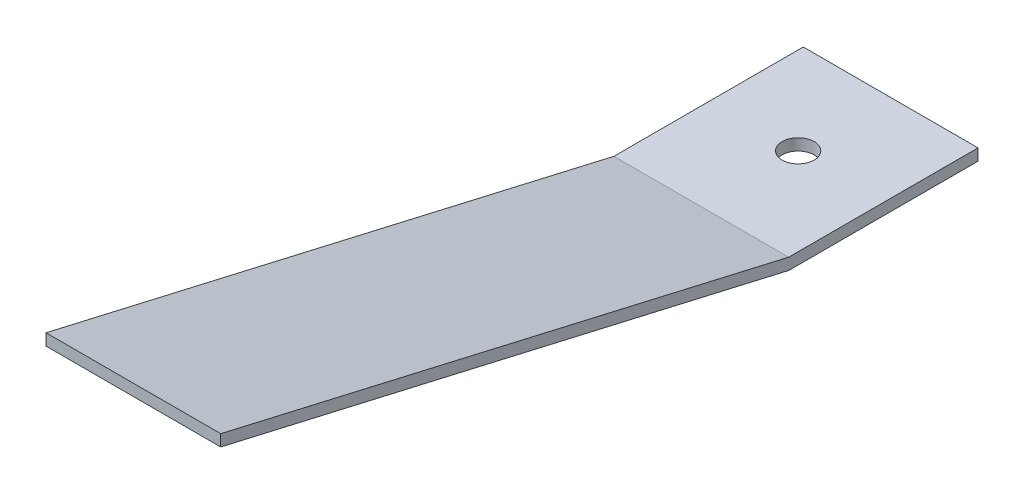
ISO-10303-21;
HEADER;
FILE_DESCRIPTION(('STEP AP214'),'2;1');
FILE_NAME('part.step','',(''),(''),'','','');
FILE_SCHEMA(('AUTOMOTIVE_DESIGN { 1 0 10303 214 1 1 1 1 }'));
ENDSEC;
DATA;
#1=APPLICATION_CONTEXT('core data for automotive mechanical design processes');
#2=APPLICATION_PROTOCOL_DEFINITION('international standard','automotive_design',2000,#1);
#3=PRODUCT_CONTEXT('',#1,'mechanical');
#4=PRODUCT('Part','Part','',(#3));
#5=PRODUCT_RELATED_PRODUCT_CATEGORY('part','',(#4));
#6=PRODUCT_DEFINITION_FORMATION('','',#4);
#7=PRODUCT_DEFINITION_CONTEXT('part definition',#1,'design');
#8=PRODUCT_DEFINITION('design','',#6,#7);
#9=PRODUCT_DEFINITION_SHAPE('','',#8);
#10=(LENGTH_UNIT() NAMED_UNIT(*) SI_UNIT(.MILLI.,.METRE.));
#11=(NAMED_UNIT(*) PLANE_ANGLE_UNIT() SI_UNIT($,.RADIAN.));
#12=(NAMED_UNIT(*) SI_UNIT($,.STERADIAN.) SOLID_ANGLE_UNIT());
#13=UNCERTAINTY_MEASURE_WITH_UNIT(LENGTH_MEASURE(1.E-05),#10,'distance_accuracy_value','');
#14=(GEOMETRIC_REPRESENTATION_CONTEXT(3) GLOBAL_UNCERTAINTY_ASSIGNED_CONTEXT((#13)) GLOBAL_UNIT_ASSIGNED_CONTEXT((#10,
#11,#12)) REPRESENTATION_CONTEXT('',''));
#15=CARTESIAN_POINT('',(0.,0.,0.));
#16=DIRECTION('',(0.,0.,1.));
#17=DIRECTION('',(1.,0.,0.));
#18=AXIS2_PLACEMENT_3D('',#15,#16,#17);
#19=CARTESIAN_POINT('',(-6.,0.79375,6.5));
#20=DIRECTION('',(1.,0.,0.));
#21=DIRECTION('',(0.,0.,-1.));
#22=AXIS2_PLACEMENT_3D('',#19,#20,#21);
#23=PLANE('',#22);
#24=DIRECTION('',(0.,0.,1.));
#25=VECTOR('',#24,1.);
#26=CARTESIAN_POINT('',(-6.,0.,6.5));
#27=LINE('',#26,#25);
#28=CARTESIAN_POINT('',(-6.,0.,-6.5));
#29=VERTEX_POINT('',#28);
#30=CARTESIAN_POINT('',(-6.,0.,6.5));
#31=VERTEX_POINT('',#30);
#32=EDGE_CURVE('E91',#29,#31,#27,.T.);
#33=ORIENTED_EDGE('',*,*,#32,.T.);
#34=DIRECTION('',(0.,-0.224951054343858,-0.974370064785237));
#35=VECTOR('',#34,1.);
#36=CARTESIAN_POINT('',(-6.,9.00385945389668,45.5));
#37=LINE('',#36,#35);
#38=CARTESIAN_POINT('',(-6.,9.00385945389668,45.5));
#39=VERTEX_POINT('',#38);
#40=EDGE_CURVE('E95',#39,#31,#37,.T.);
#41=ORIENTED_EDGE('',*,*,#40,.F.);
#42=DIRECTION('',(0.,-1.,0.));
#43=VECTOR('',#42,1.);
#44=CARTESIAN_POINT('',(-6.,9.79760945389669,45.5));
#45=LINE('',#44,#43);
#46=CARTESIAN_POINT('',(-6.,9.79760945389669,45.5));
#47=VERTEX_POINT('',#46);
#48=EDGE_CURVE('E111',#47,#39,#45,.T.);
#49=ORIENTED_EDGE('',*,*,#48,.F.);
#50=DIRECTION('',(0.,0.224951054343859,0.974370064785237));
#51=VECTOR('',#50,1.);
#52=CARTESIAN_POINT('',(-6.,0.79375,6.5));
#53=LINE('',#52,#51);
#54=CARTESIAN_POINT('',(-6.,0.79375,6.5));
#55=VERTEX_POINT('',#54);
#56=EDGE_CURVE('E107',#55,#47,#53,.T.);
#57=ORIENTED_EDGE('',*,*,#56,.F.);
#58=DIRECTION('',(0.,0.,1.));
#59=VECTOR('',#58,1.);
#60=CARTESIAN_POINT('',(-6.,0.79375,6.5));
#61=LINE('',#60,#59);
#62=CARTESIAN_POINT('',(-6.,0.79375,-6.5));
#63=VERTEX_POINT('',#62);
#64=EDGE_CURVE('E72',#63,#55,#61,.T.);
#65=ORIENTED_EDGE('',*,*,#64,.F.);
#66=DIRECTION('',(0.,-1.,0.));
#67=VECTOR('',#66,1.);
#68=CARTESIAN_POINT('',(-6.,0.79375,-6.5));
#69=LINE('',#68,#67);
#70=EDGE_CURVE('E40',#63,#29,#69,.T.);
#71=ORIENTED_EDGE('',*,*,#70,.T.);
#72=EDGE_LOOP('',(#33,#41,#49,#57,#65,#71));
#73=FACE_BOUND('',#72,.T.);
#74=ADVANCED_FACE('F32',(#73),#23,.F.);
#75=CARTESIAN_POINT('',(6.,0.79375,6.5));
#76=DIRECTION('',(-1.,0.,0.));
#77=DIRECTION('',(0.,0.,1.));
#78=AXIS2_PLACEMENT_3D('',#75,#76,#77);
#79=PLANE('',#78);
#80=DIRECTION('',(0.,0.,-1.));
#81=VECTOR('',#80,1.);
#82=CARTESIAN_POINT('',(6.,0.,6.5));
#83=LINE('',#82,#81);
#84=CARTESIAN_POINT('',(6.,0.,6.5));
#85=VERTEX_POINT('',#84);
#86=CARTESIAN_POINT('',(6.,0.,-6.5));
#87=VERTEX_POINT('',#86);
#88=EDGE_CURVE('E62',#85,#87,#83,.T.);
#89=ORIENTED_EDGE('',*,*,#88,.T.);
#90=DIRECTION('',(0.,-1.,0.));
#91=VECTOR('',#90,1.);
#92=CARTESIAN_POINT('',(6.,0.79375,-6.5));
#93=LINE('',#92,#91);
#94=CARTESIAN_POINT('',(6.,0.79375,-6.5));
#95=VERTEX_POINT('',#94);
#96=EDGE_CURVE('E11',#95,#87,#93,.T.);
#97=ORIENTED_EDGE('',*,*,#96,.F.);
#98=DIRECTION('',(0.,0.,-1.));
#99=VECTOR('',#98,1.);
#100=CARTESIAN_POINT('',(6.,0.79375,6.5));
#101=LINE('',#100,#99);
#102=CARTESIAN_POINT('',(6.,0.79375,6.5));
#103=VERTEX_POINT('',#102);
#104=EDGE_CURVE('E132',#103,#95,#101,.T.);
#105=ORIENTED_EDGE('',*,*,#104,.F.);
#106=DIRECTION('',(0.,0.224951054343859,0.974370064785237));
#107=VECTOR('',#106,1.);
#108=CARTESIAN_POINT('',(6.,0.79375,6.5));
#109=LINE('',#108,#107);
#110=CARTESIAN_POINT('',(6.,9.79760945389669,45.5));
#111=VERTEX_POINT('',#110);
#112=EDGE_CURVE('E114',#103,#111,#109,.T.);
#113=ORIENTED_EDGE('',*,*,#112,.T.);
#114=DIRECTION('',(0.,-1.,0.));
#115=VECTOR('',#114,1.);
#116=CARTESIAN_POINT('',(6.,9.79760945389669,45.5));
#117=LINE('',#116,#115);
#118=CARTESIAN_POINT('',(6.,9.00385945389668,45.5));
#119=VERTEX_POINT('',#118);
#120=EDGE_CURVE('E108',#111,#119,#117,.T.);
#121=ORIENTED_EDGE('',*,*,#120,.T.);
#122=DIRECTION('',(0.,-0.224951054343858,-0.974370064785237));
#123=VECTOR('',#122,1.);
#124=CARTESIAN_POINT('',(6.,9.00385945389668,45.5));
#125=LINE('',#124,#123);
#126=EDGE_CURVE('E122',#119,#85,#125,.T.);
#127=ORIENTED_EDGE('',*,*,#126,.T.);
#128=EDGE_LOOP('',(#89,#97,#105,#113,#121,#127));
#129=FACE_BOUND('',#128,.T.);
#130=ADVANCED_FACE('F139',(#129),#79,.F.);
#131=CARTESIAN_POINT('',(6.,0.79375,-6.5));
#132=DIRECTION('',(0.,0.,1.));
#133=DIRECTION('',(1.,0.,0.));
#134=AXIS2_PLACEMENT_3D('',#131,#132,#133);
#135=PLANE('',#134);
#136=DIRECTION('',(-1.,0.,0.));
#137=VECTOR('',#136,1.);
#138=CARTESIAN_POINT('',(6.,0.,-6.5));
#139=LINE('',#138,#137);
#140=EDGE_CURVE('E67',#87,#29,#139,.T.);
#141=ORIENTED_EDGE('',*,*,#140,.T.);
#142=ORIENTED_EDGE('',*,*,#70,.F.);
#143=DIRECTION('',(-1.,0.,0.));
#144=VECTOR('',#143,1.);
#145=CARTESIAN_POINT('',(6.,0.79375,-6.5));
#146=LINE('',#145,#144);
#147=EDGE_CURVE('E48',#95,#63,#146,.T.);
#148=ORIENTED_EDGE('',*,*,#147,.F.);
#149=ORIENTED_EDGE('',*,*,#96,.T.);
#150=EDGE_LOOP('',(#141,#142,#148,#149));
#151=FACE_BOUND('',#150,.T.);
#152=ADVANCED_FACE('F140',(#151),#135,.F.);
#153=CARTESIAN_POINT('',(0.,0.79375,0.));
#154=DIRECTION('',(0.,1.,0.));
#155=DIRECTION('',(0.,0.,1.));
#156=AXIS2_PLACEMENT_3D('',#153,#154,#155);
#157=PLANE('',#156);
#158=CARTESIAN_POINT('',(0.,0.79375,-0.150000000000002));
#159=DIRECTION('',(0.,1.,0.));
#160=DIRECTION('',(0.,0.,1.));
#161=AXIS2_PLACEMENT_3D('',#158,#159,#160);
#162=CIRCLE('',#161,1.1);
#163=CARTESIAN_POINT('',(0.,0.79375,0.949999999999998));
#164=VERTEX_POINT('',#163);
#165=EDGE_CURVE('E117',#164,#164,#162,.T.);
#166=ORIENTED_EDGE('',*,*,#165,.F.);
#167=EDGE_LOOP('',(#166));
#168=FACE_BOUND('',#167,.T.);
#169=ORIENTED_EDGE('',*,*,#64,.T.);
#170=DIRECTION('',(1.,0.,0.));
#171=VECTOR('',#170,1.);
#172=CARTESIAN_POINT('',(6.,0.79375,6.5));
#173=LINE('',#172,#171);
#174=EDGE_CURVE('E130',#55,#103,#173,.T.);
#175=ORIENTED_EDGE('',*,*,#174,.T.);
#176=ORIENTED_EDGE('',*,*,#104,.T.);
#177=ORIENTED_EDGE('',*,*,#147,.T.);
#178=EDGE_LOOP('',(#169,#175,#176,#177));
#179=FACE_BOUND('',#178,.T.);
#180=ADVANCED_FACE('F137',(#168,#179),#157,.T.);
#181=CARTESIAN_POINT('',(0.,0.,0.));
#182=DIRECTION('',(0.,1.,0.));
#183=DIRECTION('',(0.,0.,1.));
#184=AXIS2_PLACEMENT_3D('',#181,#182,#183);
#185=PLANE('',#184);
#186=CARTESIAN_POINT('',(0.,0.,-0.150000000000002));
#187=DIRECTION('',(0.,1.,0.));
#188=DIRECTION('',(0.,0.,1.));
#189=AXIS2_PLACEMENT_3D('',#186,#187,#188);
#190=CIRCLE('',#189,1.1);
#191=CARTESIAN_POINT('',(0.,0.,0.949999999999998));
#192=VERTEX_POINT('',#191);
#193=EDGE_CURVE('E124',#192,#192,#190,.T.);
#194=ORIENTED_EDGE('',*,*,#193,.T.);
#195=EDGE_LOOP('',(#194));
#196=FACE_BOUND('',#195,.T.);
#197=ORIENTED_EDGE('',*,*,#32,.F.);
#198=ORIENTED_EDGE('',*,*,#140,.F.);
#199=ORIENTED_EDGE('',*,*,#88,.F.);
#200=DIRECTION('',(1.,0.,0.));
#201=VECTOR('',#200,1.);
#202=CARTESIAN_POINT('',(6.,0.,6.5));
#203=LINE('',#202,#201);
#204=EDGE_CURVE('E98',#31,#85,#203,.T.);
#205=ORIENTED_EDGE('',*,*,#204,.F.);
#206=EDGE_LOOP('',(#197,#198,#199,#205));
#207=FACE_BOUND('',#206,.T.);
#208=ADVANCED_FACE('F102',(#196,#207),#185,.F.);
#209=CARTESIAN_POINT('',(-6.,9.00385945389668,45.5));
#210=DIRECTION('',(0.,-0.974370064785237,0.224951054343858));
#211=DIRECTION('',(0.,-0.224951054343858,-0.974370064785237));
#212=AXIS2_PLACEMENT_3D('',#209,#210,#211);
#213=PLANE('',#212);
#214=ORIENTED_EDGE('',*,*,#126,.F.);
#215=DIRECTION('',(1.,0.,0.));
#216=VECTOR('',#215,1.);
#217=CARTESIAN_POINT('',(-6.,9.00385945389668,45.5));
#218=LINE('',#217,#216);
#219=EDGE_CURVE('E99',#39,#119,#218,.T.);
#220=ORIENTED_EDGE('',*,*,#219,.F.);
#221=ORIENTED_EDGE('',*,*,#40,.T.);
#222=ORIENTED_EDGE('',*,*,#204,.T.);
#223=EDGE_LOOP('',(#214,#220,#221,#222));
#224=FACE_BOUND('',#223,.T.);
#225=ADVANCED_FACE('F106',(#224),#213,.T.);
#226=CARTESIAN_POINT('',(-6.,9.79760945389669,45.5));
#227=DIRECTION('',(0.,0.,1.));
#228=DIRECTION('',(1.,0.,0.));
#229=AXIS2_PLACEMENT_3D('',#226,#227,#228);
#230=PLANE('',#229);
#231=ORIENTED_EDGE('',*,*,#120,.F.);
#232=DIRECTION('',(1.,0.,0.));
#233=VECTOR('',#232,1.);
#234=CARTESIAN_POINT('',(-6.,9.79760945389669,45.5));
#235=LINE('',#234,#233);
#236=EDGE_CURVE('E121',#47,#111,#235,.T.);
#237=ORIENTED_EDGE('',*,*,#236,.F.);
#238=ORIENTED_EDGE('',*,*,#48,.T.);
#239=ORIENTED_EDGE('',*,*,#219,.T.);
#240=EDGE_LOOP('',(#231,#237,#238,#239));
#241=FACE_BOUND('',#240,.T.);
#242=ADVANCED_FACE('F146',(#241),#230,.T.);
#243=CARTESIAN_POINT('',(-6.,0.79375,6.5));
#244=DIRECTION('',(0.,0.974370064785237,-0.224951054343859));
#245=DIRECTION('',(0.,0.224951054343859,0.974370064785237));
#246=AXIS2_PLACEMENT_3D('',#243,#244,#245);
#247=PLANE('',#246);
#248=ORIENTED_EDGE('',*,*,#112,.F.);
#249=ORIENTED_EDGE('',*,*,#174,.F.);
#250=ORIENTED_EDGE('',*,*,#56,.T.);
#251=ORIENTED_EDGE('',*,*,#236,.T.);
#252=EDGE_LOOP('',(#248,#249,#250,#251));
#253=FACE_BOUND('',#252,.T.);
#254=ADVANCED_FACE('F143',(#253),#247,.T.);
#255=CARTESIAN_POINT('',(0.,0.,-0.150000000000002));
#256=DIRECTION('',(0.,1.,0.));
#257=DIRECTION('',(0.,0.,1.));
#258=AXIS2_PLACEMENT_3D('',#255,#256,#257);
#259=CYLINDRICAL_SURFACE('',#258,1.1);
#260=ORIENTED_EDGE('',*,*,#193,.F.);
#261=EDGE_LOOP('',(#260));
#262=FACE_BOUND('',#261,.T.);
#263=ORIENTED_EDGE('',*,*,#165,.T.);
#264=EDGE_LOOP('',(#263));
#265=FACE_BOUND('',#264,.T.);
#266=ADVANCED_FACE('F153',(#262,#265),#259,.F.);
#267=CLOSED_SHELL('',(#74,#130,#152,#180,#208,#225,#242,#254,#266));
#268=MANIFOLD_SOLID_BREP('B2',#267);
#269=ADVANCED_BREP_SHAPE_REPRESENTATION('',(#18,#268),#14);
#270=SHAPE_DEFINITION_REPRESENTATION(#9,#269);
ENDSEC;
END-ISO-10303-21;
